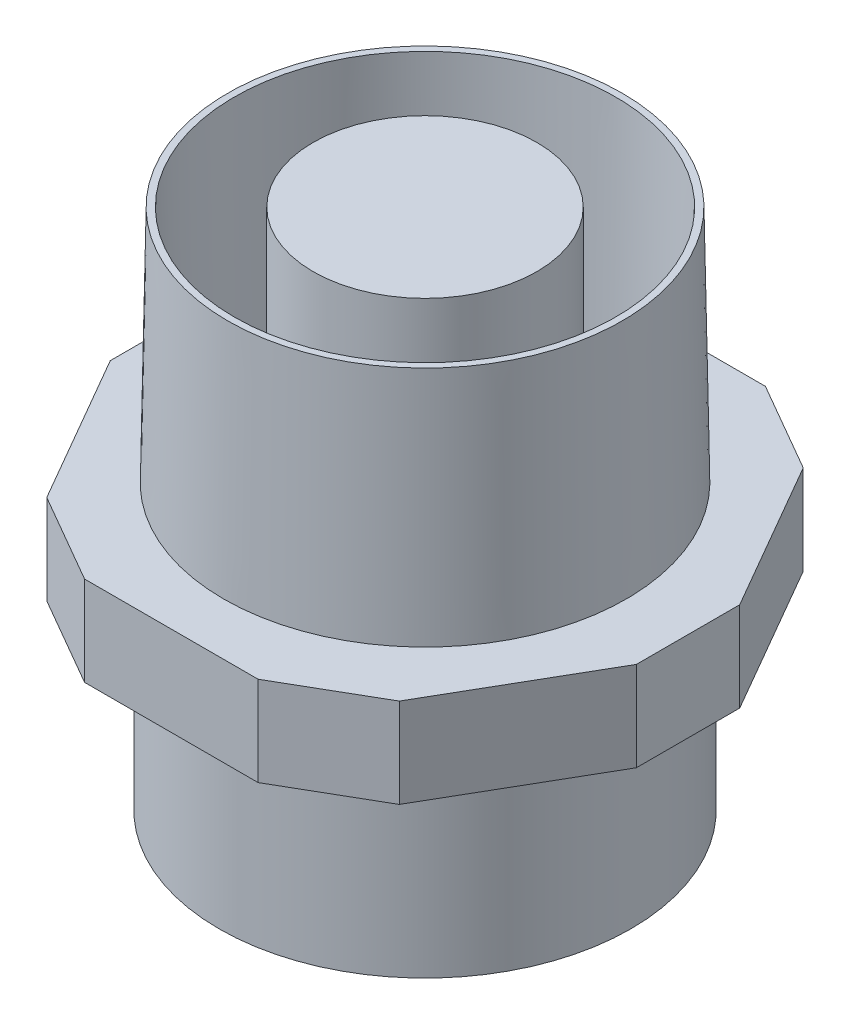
ISO-10303-21;
HEADER;
FILE_DESCRIPTION(('STEP AP214'),'2;1');
FILE_NAME('part.step','',(''),(''),'','','');
FILE_SCHEMA(('AUTOMOTIVE_DESIGN { 1 0 10303 214 1 1 1 1 }'));
ENDSEC;
DATA;
#1=APPLICATION_CONTEXT('core data for automotive mechanical design processes');
#2=APPLICATION_PROTOCOL_DEFINITION('international standard','automotive_design',2000,#1);
#3=PRODUCT_CONTEXT('',#1,'mechanical');
#4=PRODUCT('Part','Part','',(#3));
#5=PRODUCT_RELATED_PRODUCT_CATEGORY('part','',(#4));
#6=PRODUCT_DEFINITION_FORMATION('','',#4);
#7=PRODUCT_DEFINITION_CONTEXT('part definition',#1,'design');
#8=PRODUCT_DEFINITION('design','',#6,#7);
#9=PRODUCT_DEFINITION_SHAPE('','',#8);
#10=(LENGTH_UNIT() NAMED_UNIT(*) SI_UNIT(.MILLI.,.METRE.));
#11=(NAMED_UNIT(*) PLANE_ANGLE_UNIT() SI_UNIT($,.RADIAN.));
#12=(NAMED_UNIT(*) SI_UNIT($,.STERADIAN.) SOLID_ANGLE_UNIT());
#13=UNCERTAINTY_MEASURE_WITH_UNIT(LENGTH_MEASURE(1.E-05),#10,'distance_accuracy_value','');
#14=(GEOMETRIC_REPRESENTATION_CONTEXT(3) GLOBAL_UNCERTAINTY_ASSIGNED_CONTEXT((#13)) GLOBAL_UNIT_ASSIGNED_CONTEXT((#10,
#11,#12)) REPRESENTATION_CONTEXT('',''));
#15=CARTESIAN_POINT('',(0.,0.,0.));
#16=DIRECTION('',(0.,0.,1.));
#17=DIRECTION('',(1.,0.,0.));
#18=AXIS2_PLACEMENT_3D('',#15,#16,#17);
#19=CARTESIAN_POINT('',(9.81495457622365,3.,0.));
#20=DIRECTION('',(0.,1.,0.));
#21=DIRECTION('',(0.,0.,1.));
#22=AXIS2_PLACEMENT_3D('',#19,#20,#21);
#23=PLANE('',#22);
#24=CARTESIAN_POINT('',(0.,3.,0.));
#25=DIRECTION('',(0.,1.,0.));
#26=DIRECTION('',(0.,0.,1.));
#27=AXIS2_PLACEMENT_3D('',#24,#25,#26);
#28=CIRCLE('',#27,6.25);
#29=CARTESIAN_POINT('',(0.,3.,6.25));
#30=VERTEX_POINT('',#29);
#31=EDGE_CURVE('E176',#30,#30,#28,.F.);
#32=ORIENTED_EDGE('',*,*,#31,.F.);
#33=EDGE_LOOP('',(#32));
#34=FACE_BOUND('',#33,.T.);
#35=CARTESIAN_POINT('',(0.,3.,0.));
#36=DIRECTION('',(0.,1.,0.));
#37=DIRECTION('',(0.,0.,1.));
#38=AXIS2_PLACEMENT_3D('',#35,#36,#37);
#39=CIRCLE('',#38,3.75);
#40=CARTESIAN_POINT('',(0.,3.,3.75));
#41=VERTEX_POINT('',#40);
#42=EDGE_CURVE('E255',#41,#41,#39,.T.);
#43=ORIENTED_EDGE('',*,*,#42,.F.);
#44=EDGE_LOOP('',(#43));
#45=FACE_BOUND('',#44,.T.);
#46=ADVANCED_FACE('F38',(#34,#45),#23,.T.);
#47=CARTESIAN_POINT('',(9.81495457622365,0.,0.));
#48=DIRECTION('',(0.,1.,0.));
#49=DIRECTION('',(0.,0.,1.));
#50=AXIS2_PLACEMENT_3D('',#47,#48,#49);
#51=PLANE('',#50);
#52=DIRECTION('',(0.5,0.,-0.866025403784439));
#53=VECTOR('',#52,1.);
#54=CARTESIAN_POINT('',(4.90747728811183,0.,8.5));
#55=LINE('',#54,#53);
#56=CARTESIAN_POINT('',(5.90747728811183,0.,6.76794919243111));
#57=VERTEX_POINT('',#56);
#58=CARTESIAN_POINT('',(8.81495457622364,0.,1.73205080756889));
#59=VERTEX_POINT('',#58);
#60=EDGE_CURVE('E144',#57,#59,#55,.T.);
#61=ORIENTED_EDGE('',*,*,#60,.F.);
#62=DIRECTION('',(0.866025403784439,0.,-0.5));
#63=VECTOR('',#62,1.);
#64=CARTESIAN_POINT('',(5.90747728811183,0.,6.76794919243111));
#65=LINE('',#64,#63);
#66=CARTESIAN_POINT('',(2.90747728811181,0.,8.5));
#67=VERTEX_POINT('',#66);
#68=EDGE_CURVE('E127',#57,#67,#65,.F.);
#69=ORIENTED_EDGE('',*,*,#68,.T.);
#70=DIRECTION('',(1.,0.,0.));
#71=VECTOR('',#70,1.);
#72=CARTESIAN_POINT('',(-4.90747728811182,0.,8.5));
#73=LINE('',#72,#71);
#74=CARTESIAN_POINT('',(-2.90747728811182,0.,8.5));
#75=VERTEX_POINT('',#74);
#76=EDGE_CURVE('E174',#75,#67,#73,.T.);
#77=ORIENTED_EDGE('',*,*,#76,.F.);
#78=DIRECTION('',(0.866025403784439,0.,0.5));
#79=VECTOR('',#78,1.);
#80=CARTESIAN_POINT('',(-2.90747728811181,0.,8.5));
#81=LINE('',#80,#79);
#82=CARTESIAN_POINT('',(-5.90747728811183,0.,6.76794919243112));
#83=VERTEX_POINT('',#82);
#84=EDGE_CURVE('E184',#75,#83,#81,.F.);
#85=ORIENTED_EDGE('',*,*,#84,.T.);
#86=DIRECTION('',(0.5,0.,0.866025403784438));
#87=VECTOR('',#86,1.);
#88=CARTESIAN_POINT('',(-9.81495457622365,0.,0.));
#89=LINE('',#88,#87);
#90=CARTESIAN_POINT('',(-8.81495457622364,0.,1.73205080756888));
#91=VERTEX_POINT('',#90);
#92=EDGE_CURVE('E172',#91,#83,#89,.T.);
#93=ORIENTED_EDGE('',*,*,#92,.F.);
#94=DIRECTION('',(0.,0.,1.));
#95=VECTOR('',#94,1.);
#96=CARTESIAN_POINT('',(-8.81495457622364,0.,1.73205080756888));
#97=LINE('',#96,#95);
#98=CARTESIAN_POINT('',(-8.81495457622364,0.,-1.73205080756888));
#99=VERTEX_POINT('',#98);
#100=EDGE_CURVE('E148',#91,#99,#97,.F.);
#101=ORIENTED_EDGE('',*,*,#100,.T.);
#102=DIRECTION('',(-0.5,0.,0.866025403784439));
#103=VECTOR('',#102,1.);
#104=CARTESIAN_POINT('',(-4.90747728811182,0.,-8.50000000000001));
#105=LINE('',#104,#103);
#106=CARTESIAN_POINT('',(-5.90747728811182,0.,-6.76794919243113));
#107=VERTEX_POINT('',#106);
#108=EDGE_CURVE('E169',#107,#99,#105,.T.);
#109=ORIENTED_EDGE('',*,*,#108,.F.);
#110=DIRECTION('',(-0.866025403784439,0.,0.5));
#111=VECTOR('',#110,1.);
#112=CARTESIAN_POINT('',(-5.90747728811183,0.,-6.76794919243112));
#113=LINE('',#112,#111);
#114=CARTESIAN_POINT('',(-2.90747728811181,0.,-8.50000000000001));
#115=VERTEX_POINT('',#114);
#116=EDGE_CURVE('E186',#107,#115,#113,.F.);
#117=ORIENTED_EDGE('',*,*,#116,.T.);
#118=DIRECTION('',(-1.,0.,0.));
#119=VECTOR('',#118,1.);
#120=CARTESIAN_POINT('',(4.90747728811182,0.,-8.50000000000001));
#121=LINE('',#120,#119);
#122=CARTESIAN_POINT('',(2.90747728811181,0.,-8.50000000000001));
#123=VERTEX_POINT('',#122);
#124=EDGE_CURVE('E158',#123,#115,#121,.T.);
#125=ORIENTED_EDGE('',*,*,#124,.F.);
#126=DIRECTION('',(-0.866025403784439,0.,-0.5));
#127=VECTOR('',#126,1.);
#128=CARTESIAN_POINT('',(2.90747728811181,0.,-8.50000000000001));
#129=LINE('',#128,#127);
#130=CARTESIAN_POINT('',(5.90747728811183,0.,-6.76794919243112));
#131=VERTEX_POINT('',#130);
#132=EDGE_CURVE('E188',#123,#131,#129,.F.);
#133=ORIENTED_EDGE('',*,*,#132,.T.);
#134=DIRECTION('',(-0.5,0.,-0.866025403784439));
#135=VECTOR('',#134,1.);
#136=CARTESIAN_POINT('',(9.81495457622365,0.,0.));
#137=LINE('',#136,#135);
#138=CARTESIAN_POINT('',(8.81495457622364,0.,-1.73205080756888));
#139=VERTEX_POINT('',#138);
#140=EDGE_CURVE('E154',#139,#131,#137,.T.);
#141=ORIENTED_EDGE('',*,*,#140,.F.);
#142=DIRECTION('',(0.,0.,-1.));
#143=VECTOR('',#142,1.);
#144=CARTESIAN_POINT('',(8.81495457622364,0.,-1.73205080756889));
#145=LINE('',#144,#143);
#146=EDGE_CURVE('E138',#139,#59,#145,.F.);
#147=ORIENTED_EDGE('',*,*,#146,.T.);
#148=EDGE_LOOP('',(#61,#69,#77,#85,#93,#101,#109,#117,#125,#133,#141,#147));
#149=FACE_BOUND('',#148,.T.);
#150=CARTESIAN_POINT('',(0.,0.,0.));
#151=DIRECTION('',(0.,1.,0.));
#152=DIRECTION('',(0.,0.,1.));
#153=AXIS2_PLACEMENT_3D('',#150,#151,#152);
#154=CIRCLE('',#153,6.9);
#155=CARTESIAN_POINT('',(0.,0.,6.9));
#156=VERTEX_POINT('',#155);
#157=EDGE_CURVE('E179',#156,#156,#154,.F.);
#158=ORIENTED_EDGE('',*,*,#157,.F.);
#159=EDGE_LOOP('',(#158));
#160=FACE_BOUND('',#159,.T.);
#161=ADVANCED_FACE('F151',(#149,#160),#51,.F.);
#162=DIRECTION('',(1.,0.,0.));
#163=VECTOR('',#162,1.);
#164=CARTESIAN_POINT('',(-4.90747728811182,3.,8.5));
#165=LINE('',#164,#163);
#166=CARTESIAN_POINT('',(-2.90747728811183,3.,8.5));
#167=VERTEX_POINT('',#166);
#168=CARTESIAN_POINT('',(2.90747728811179,3.,8.50000000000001));
#169=VERTEX_POINT('',#168);
#170=EDGE_CURVE('E164',#167,#169,#165,.T.);
#171=ORIENTED_EDGE('',*,*,#170,.T.);
#172=DIRECTION('',(-0.866025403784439,0.,0.5));
#173=VECTOR('',#172,1.);
#174=CARTESIAN_POINT('',(11.7686932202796,3.,3.38397459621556));
#175=LINE('',#174,#173);
#176=CARTESIAN_POINT('',(5.90747728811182,3.,6.76794919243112));
#177=VERTEX_POINT('',#176);
#178=EDGE_CURVE('E203',#169,#177,#175,.F.);
#179=ORIENTED_EDGE('',*,*,#178,.T.);
#180=DIRECTION('',(0.5,0.,-0.866025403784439));
#181=VECTOR('',#180,1.);
#182=CARTESIAN_POINT('',(4.90747728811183,3.,8.5));
#183=LINE('',#182,#181);
#184=CARTESIAN_POINT('',(8.81495457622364,3.,1.73205080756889));
#185=VERTEX_POINT('',#184);
#186=EDGE_CURVE('E147',#177,#185,#183,.T.);
#187=ORIENTED_EDGE('',*,*,#186,.T.);
#188=DIRECTION('',(0.,0.,1.));
#189=VECTOR('',#188,1.);
#190=CARTESIAN_POINT('',(8.81495457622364,3.,0.));
#191=LINE('',#190,#189);
#192=CARTESIAN_POINT('',(8.81495457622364,3.,-1.73205080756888));
#193=VERTEX_POINT('',#192);
#194=EDGE_CURVE('E201',#185,#193,#191,.F.);
#195=ORIENTED_EDGE('',*,*,#194,.T.);
#196=DIRECTION('',(-0.5,0.,-0.866025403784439));
#197=VECTOR('',#196,1.);
#198=CARTESIAN_POINT('',(9.81495457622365,3.,0.));
#199=LINE('',#198,#197);
#200=CARTESIAN_POINT('',(5.90747728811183,3.,-6.76794919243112));
#201=VERTEX_POINT('',#200);
#202=EDGE_CURVE('E240',#193,#201,#199,.T.);
#203=ORIENTED_EDGE('',*,*,#202,.T.);
#204=DIRECTION('',(0.866025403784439,0.,0.5));
#205=VECTOR('',#204,1.);
#206=CARTESIAN_POINT('',(11.7686932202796,3.,-3.38397459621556));
#207=LINE('',#206,#205);
#208=CARTESIAN_POINT('',(2.9074772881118,3.,-8.50000000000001));
#209=VERTEX_POINT('',#208);
#210=EDGE_CURVE('E199',#201,#209,#207,.F.);
#211=ORIENTED_EDGE('',*,*,#210,.T.);
#212=DIRECTION('',(-1.,0.,0.));
#213=VECTOR('',#212,1.);
#214=CARTESIAN_POINT('',(4.90747728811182,3.,-8.50000000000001));
#215=LINE('',#214,#213);
#216=CARTESIAN_POINT('',(-2.90747728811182,3.,-8.50000000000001));
#217=VERTEX_POINT('',#216);
#218=EDGE_CURVE('E235',#209,#217,#215,.T.);
#219=ORIENTED_EDGE('',*,*,#218,.T.);
#220=DIRECTION('',(0.866025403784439,0.,-0.5));
#221=VECTOR('',#220,1.);
#222=CARTESIAN_POINT('',(2.95373864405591,3.,-11.8839745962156));
#223=LINE('',#222,#221);
#224=CARTESIAN_POINT('',(-5.90747728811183,3.,-6.76794919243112));
#225=VERTEX_POINT('',#224);
#226=EDGE_CURVE('E197',#217,#225,#223,.F.);
#227=ORIENTED_EDGE('',*,*,#226,.T.);
#228=DIRECTION('',(-0.5,0.,0.866025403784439));
#229=VECTOR('',#228,1.);
#230=CARTESIAN_POINT('',(-4.90747728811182,3.,-8.50000000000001));
#231=LINE('',#230,#229);
#232=CARTESIAN_POINT('',(-8.81495457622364,3.,-1.73205080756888));
#233=VERTEX_POINT('',#232);
#234=EDGE_CURVE('E234',#225,#233,#231,.T.);
#235=ORIENTED_EDGE('',*,*,#234,.T.);
#236=DIRECTION('',(0.,0.,-1.));
#237=VECTOR('',#236,1.);
#238=CARTESIAN_POINT('',(-8.81495457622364,3.,0.));
#239=LINE('',#238,#237);
#240=CARTESIAN_POINT('',(-8.81495457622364,3.,1.73205080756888));
#241=VERTEX_POINT('',#240);
#242=EDGE_CURVE('E58',#233,#241,#239,.F.);
#243=ORIENTED_EDGE('',*,*,#242,.T.);
#244=DIRECTION('',(0.5,0.,0.866025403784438));
#245=VECTOR('',#244,1.);
#246=CARTESIAN_POINT('',(-9.81495457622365,3.,0.));
#247=LINE('',#246,#245);
#248=CARTESIAN_POINT('',(-5.90747728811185,3.,6.76794919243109));
#249=VERTEX_POINT('',#248);
#250=EDGE_CURVE('E223',#241,#249,#247,.T.);
#251=ORIENTED_EDGE('',*,*,#250,.T.);
#252=DIRECTION('',(-0.866025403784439,0.,-0.5));
#253=VECTOR('',#252,1.);
#254=CARTESIAN_POINT('',(2.95373864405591,3.,11.8839745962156));
#255=LINE('',#254,#253);
#256=EDGE_CURVE('E195',#249,#167,#255,.F.);
#257=ORIENTED_EDGE('',*,*,#256,.T.);
#258=EDGE_LOOP('',(#171,#179,#187,#195,#203,#211,#219,#227,#235,#243,#251,#257));
#259=FACE_BOUND('',#258,.T.);
#260=CARTESIAN_POINT('',(0.,3.,0.));
#261=DIRECTION('',(0.,1.,0.));
#262=DIRECTION('',(0.,0.,1.));
#263=AXIS2_PLACEMENT_3D('',#260,#261,#262);
#264=CIRCLE('',#263,6.75);
#265=CARTESIAN_POINT('',(0.,3.,6.75));
#266=VERTEX_POINT('',#265);
#267=EDGE_CURVE('E161',#266,#266,#264,.T.);
#268=ORIENTED_EDGE('',*,*,#267,.F.);
#269=EDGE_LOOP('',(#268));
#270=FACE_BOUND('',#269,.T.);
#271=ADVANCED_FACE('F265',(#259,#270),#23,.T.);
#272=CARTESIAN_POINT('',(4.90747728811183,3.,8.5));
#273=DIRECTION('',(-0.866025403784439,0.,-0.5));
#274=DIRECTION('',(-0.5,0.,0.866025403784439));
#275=AXIS2_PLACEMENT_3D('',#272,#273,#274);
#276=PLANE('',#275);
#277=ORIENTED_EDGE('',*,*,#186,.F.);
#278=DIRECTION('',(0.,-1.,0.));
#279=VECTOR('',#278,1.);
#280=CARTESIAN_POINT('',(5.90747728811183,3.,6.76794919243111));
#281=LINE('',#280,#279);
#282=EDGE_CURVE('E131',#177,#57,#281,.T.);
#283=ORIENTED_EDGE('',*,*,#282,.T.);
#284=ORIENTED_EDGE('',*,*,#60,.T.);
#285=DIRECTION('',(0.,1.,0.));
#286=VECTOR('',#285,1.);
#287=CARTESIAN_POINT('',(8.81495457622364,3.,1.73205080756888));
#288=LINE('',#287,#286);
#289=EDGE_CURVE('E149',#59,#185,#288,.T.);
#290=ORIENTED_EDGE('',*,*,#289,.T.);
#291=EDGE_LOOP('',(#277,#283,#284,#290));
#292=FACE_BOUND('',#291,.T.);
#293=ADVANCED_FACE('F143',(#292),#276,.F.);
#294=CARTESIAN_POINT('',(9.81495457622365,3.,0.));
#295=DIRECTION('',(-0.866025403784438,0.,0.5));
#296=DIRECTION('',(0.5,0.,0.866025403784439));
#297=AXIS2_PLACEMENT_3D('',#294,#295,#296);
#298=PLANE('',#297);
#299=ORIENTED_EDGE('',*,*,#202,.F.);
#300=DIRECTION('',(0.,-1.,0.));
#301=VECTOR('',#300,1.);
#302=CARTESIAN_POINT('',(8.81495457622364,3.,-1.73205080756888));
#303=LINE('',#302,#301);
#304=EDGE_CURVE('E207',#193,#139,#303,.T.);
#305=ORIENTED_EDGE('',*,*,#304,.T.);
#306=ORIENTED_EDGE('',*,*,#140,.T.);
#307=DIRECTION('',(0.,1.,0.));
#308=VECTOR('',#307,1.);
#309=CARTESIAN_POINT('',(5.90747728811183,3.,-6.76794919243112));
#310=LINE('',#309,#308);
#311=EDGE_CURVE('E205',#131,#201,#310,.T.);
#312=ORIENTED_EDGE('',*,*,#311,.T.);
#313=EDGE_LOOP('',(#299,#305,#306,#312));
#314=FACE_BOUND('',#313,.T.);
#315=ADVANCED_FACE('F275',(#314),#298,.F.);
#316=CARTESIAN_POINT('',(4.90747728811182,3.,-8.50000000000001));
#317=DIRECTION('',(0.,0.,1.));
#318=DIRECTION('',(1.,0.,0.));
#319=AXIS2_PLACEMENT_3D('',#316,#317,#318);
#320=PLANE('',#319);
#321=ORIENTED_EDGE('',*,*,#218,.F.);
#322=DIRECTION('',(0.,-1.,0.));
#323=VECTOR('',#322,1.);
#324=CARTESIAN_POINT('',(2.90747728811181,3.,-8.50000000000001));
#325=LINE('',#324,#323);
#326=EDGE_CURVE('E212',#209,#123,#325,.T.);
#327=ORIENTED_EDGE('',*,*,#326,.T.);
#328=ORIENTED_EDGE('',*,*,#124,.T.);
#329=DIRECTION('',(0.,1.,0.));
#330=VECTOR('',#329,1.);
#331=CARTESIAN_POINT('',(-2.90747728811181,3.,-8.50000000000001));
#332=LINE('',#331,#330);
#333=EDGE_CURVE('E210',#115,#217,#332,.T.);
#334=ORIENTED_EDGE('',*,*,#333,.T.);
#335=EDGE_LOOP('',(#321,#327,#328,#334));
#336=FACE_BOUND('',#335,.T.);
#337=ADVANCED_FACE('F326',(#336),#320,.F.);
#338=CARTESIAN_POINT('',(-4.90747728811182,3.,-8.50000000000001));
#339=DIRECTION('',(0.866025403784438,0.,0.5));
#340=DIRECTION('',(0.5,0.,-0.866025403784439));
#341=AXIS2_PLACEMENT_3D('',#338,#339,#340);
#342=PLANE('',#341);
#343=ORIENTED_EDGE('',*,*,#234,.F.);
#344=DIRECTION('',(0.,-1.,0.));
#345=VECTOR('',#344,1.);
#346=CARTESIAN_POINT('',(-5.90747728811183,3.,-6.76794919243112));
#347=LINE('',#346,#345);
#348=EDGE_CURVE('E217',#225,#107,#347,.T.);
#349=ORIENTED_EDGE('',*,*,#348,.T.);
#350=ORIENTED_EDGE('',*,*,#108,.T.);
#351=DIRECTION('',(0.,1.,0.));
#352=VECTOR('',#351,1.);
#353=CARTESIAN_POINT('',(-8.81495457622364,3.,-1.73205080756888));
#354=LINE('',#353,#352);
#355=EDGE_CURVE('E215',#99,#233,#354,.T.);
#356=ORIENTED_EDGE('',*,*,#355,.T.);
#357=EDGE_LOOP('',(#343,#349,#350,#356));
#358=FACE_BOUND('',#357,.T.);
#359=ADVANCED_FACE('F318',(#358),#342,.F.);
#360=CARTESIAN_POINT('',(-9.81495457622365,3.,0.));
#361=DIRECTION('',(0.866025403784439,0.,-0.5));
#362=DIRECTION('',(-0.5,0.,-0.866025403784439));
#363=AXIS2_PLACEMENT_3D('',#360,#361,#362);
#364=PLANE('',#363);
#365=ORIENTED_EDGE('',*,*,#92,.T.);
#366=DIRECTION('',(0.,1.,0.));
#367=VECTOR('',#366,1.);
#368=CARTESIAN_POINT('',(-5.90747728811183,3.,6.76794919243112));
#369=LINE('',#368,#367);
#370=EDGE_CURVE('E11',#83,#249,#369,.T.);
#371=ORIENTED_EDGE('',*,*,#370,.T.);
#372=ORIENTED_EDGE('',*,*,#250,.F.);
#373=DIRECTION('',(0.,-1.,0.));
#374=VECTOR('',#373,1.);
#375=CARTESIAN_POINT('',(-8.81495457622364,3.,1.73205080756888));
#376=LINE('',#375,#374);
#377=EDGE_CURVE('E46',#241,#91,#376,.T.);
#378=ORIENTED_EDGE('',*,*,#377,.T.);
#379=EDGE_LOOP('',(#365,#371,#372,#378));
#380=FACE_BOUND('',#379,.T.);
#381=ADVANCED_FACE('F222',(#380),#364,.F.);
#382=CARTESIAN_POINT('',(-4.90747728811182,3.,8.5));
#383=DIRECTION('',(0.,0.,-1.));
#384=DIRECTION('',(-1.,0.,0.));
#385=AXIS2_PLACEMENT_3D('',#382,#383,#384);
#386=PLANE('',#385);
#387=ORIENTED_EDGE('',*,*,#76,.T.);
#388=DIRECTION('',(0.,1.,0.));
#389=VECTOR('',#388,1.);
#390=CARTESIAN_POINT('',(2.90747728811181,3.,8.5));
#391=LINE('',#390,#389);
#392=EDGE_CURVE('E132',#67,#169,#391,.T.);
#393=ORIENTED_EDGE('',*,*,#392,.T.);
#394=ORIENTED_EDGE('',*,*,#170,.F.);
#395=DIRECTION('',(0.,-1.,0.));
#396=VECTOR('',#395,1.);
#397=CARTESIAN_POINT('',(-2.90747728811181,3.,8.5));
#398=LINE('',#397,#396);
#399=EDGE_CURVE('E137',#167,#75,#398,.T.);
#400=ORIENTED_EDGE('',*,*,#399,.T.);
#401=EDGE_LOOP('',(#387,#393,#394,#400));
#402=FACE_BOUND('',#401,.T.);
#403=ADVANCED_FACE('F232',(#402),#386,.F.);
#404=CARTESIAN_POINT('',(0.,11.,0.));
#405=DIRECTION('',(0.,1.,0.));
#406=DIRECTION('',(0.,0.,1.));
#407=AXIS2_PLACEMENT_3D('',#404,#405,#406);
#408=PLANE('',#407);
#409=CARTESIAN_POINT('',(0.,11.,0.));
#410=DIRECTION('',(0.,1.,0.));
#411=DIRECTION('',(0.,0.,1.));
#412=AXIS2_PLACEMENT_3D('',#409,#410,#411);
#413=CIRCLE('',#412,6.61035948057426);
#414=CARTESIAN_POINT('',(0.,11.,6.61035948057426));
#415=VERTEX_POINT('',#414);
#416=EDGE_CURVE('E155',#415,#415,#413,.T.);
#417=ORIENTED_EDGE('',*,*,#416,.T.);
#418=EDGE_LOOP('',(#417));
#419=FACE_BOUND('',#418,.T.);
#420=CARTESIAN_POINT('',(0.,11.,0.));
#421=DIRECTION('',(0.,1.,0.));
#422=DIRECTION('',(0.,0.,1.));
#423=AXIS2_PLACEMENT_3D('',#420,#421,#422);
#424=CIRCLE('',#423,6.38964051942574);
#425=CARTESIAN_POINT('',(0.,11.,6.38964051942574));
#426=VERTEX_POINT('',#425);
#427=EDGE_CURVE('E244',#426,#426,#424,.T.);
#428=ORIENTED_EDGE('',*,*,#427,.F.);
#429=EDGE_LOOP('',(#428));
#430=FACE_BOUND('',#429,.T.);
#431=ADVANCED_FACE('F283',(#419,#430),#408,.T.);
#432=CARTESIAN_POINT('',(0.,3.,0.));
#433=DIRECTION('',(0.,-1.,0.));
#434=DIRECTION('',(0.,0.,1.));
#435=AXIS2_PLACEMENT_3D('',#432,#433,#434);
#436=CONICAL_SURFACE('',#435,6.75,0.0174532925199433);
#437=ORIENTED_EDGE('',*,*,#416,.F.);
#438=EDGE_LOOP('',(#437));
#439=FACE_BOUND('',#438,.T.);
#440=ORIENTED_EDGE('',*,*,#267,.T.);
#441=EDGE_LOOP('',(#440));
#442=FACE_BOUND('',#441,.T.);
#443=ADVANCED_FACE('F280',(#439,#442),#436,.T.);
#444=CARTESIAN_POINT('',(0.,3.,0.));
#445=DIRECTION('',(0.,1.,0.));
#446=DIRECTION('',(0.,0.,1.));
#447=AXIS2_PLACEMENT_3D('',#444,#445,#446);
#448=CONICAL_SURFACE('',#447,6.25,0.0174532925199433);
#449=ORIENTED_EDGE('',*,*,#427,.T.);
#450=EDGE_LOOP('',(#449));
#451=FACE_BOUND('',#450,.T.);
#452=ORIENTED_EDGE('',*,*,#31,.T.);
#453=EDGE_LOOP('',(#452));
#454=FACE_BOUND('',#453,.T.);
#455=ADVANCED_FACE('F282',(#451,#454),#448,.F.);
#456=CARTESIAN_POINT('',(0.,-6.5,0.));
#457=DIRECTION('',(0.,1.,0.));
#458=DIRECTION('',(0.,0.,1.));
#459=AXIS2_PLACEMENT_3D('',#456,#457,#458);
#460=CYLINDRICAL_SURFACE('',#459,6.9);
#461=CARTESIAN_POINT('',(0.,-6.5,0.));
#462=DIRECTION('',(0.,-1.,0.));
#463=DIRECTION('',(0.,0.,-1.));
#464=AXIS2_PLACEMENT_3D('',#461,#462,#463);
#465=CIRCLE('',#464,6.9);
#466=CARTESIAN_POINT('',(0.,-6.5,6.9));
#467=VERTEX_POINT('',#466);
#468=EDGE_CURVE('E246',#467,#467,#465,.T.);
#469=CARTESIAN_POINT('',(0.,-6.5,6.9));
#470=CARTESIAN_POINT('',(0.,-6.43229166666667,6.9));
#471=CARTESIAN_POINT('',(0.,-6.36458333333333,6.9));
#472=CARTESIAN_POINT('',(0.,-6.22916666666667,6.9));
#473=CARTESIAN_POINT('',(0.,-6.16145833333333,6.9));
#474=CARTESIAN_POINT('',(0.,-6.02604166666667,6.9));
#475=CARTESIAN_POINT('',(0.,-5.95833333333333,6.9));
#476=CARTESIAN_POINT('',(0.,-5.82291666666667,6.9));
#477=CARTESIAN_POINT('',(0.,-5.75520833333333,6.9));
#478=CARTESIAN_POINT('',(0.,-5.61979166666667,6.9));
#479=CARTESIAN_POINT('',(0.,-5.55208333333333,6.9));
#480=CARTESIAN_POINT('',(0.,-5.41666666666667,6.9));
#481=CARTESIAN_POINT('',(0.,-5.34895833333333,6.9));
#482=CARTESIAN_POINT('',(0.,-5.21354166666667,6.9));
#483=CARTESIAN_POINT('',(0.,-5.14583333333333,6.9));
#484=CARTESIAN_POINT('',(0.,-5.01041666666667,6.9));
#485=CARTESIAN_POINT('',(0.,-4.94270833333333,6.9));
#486=CARTESIAN_POINT('',(0.,-4.80729166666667,6.9));
#487=CARTESIAN_POINT('',(0.,-4.73958333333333,6.9));
#488=CARTESIAN_POINT('',(0.,-4.60416666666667,6.9));
#489=CARTESIAN_POINT('',(0.,-4.53645833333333,6.9));
#490=CARTESIAN_POINT('',(0.,-4.40104166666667,6.9));
#491=CARTESIAN_POINT('',(0.,-4.33333333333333,6.9));
#492=CARTESIAN_POINT('',(0.,-4.19791666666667,6.9));
#493=CARTESIAN_POINT('',(0.,-4.13020833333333,6.9));
#494=CARTESIAN_POINT('',(0.,-3.99479166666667,6.9));
#495=CARTESIAN_POINT('',(0.,-3.92708333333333,6.9));
#496=CARTESIAN_POINT('',(0.,-3.79166666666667,6.9));
#497=CARTESIAN_POINT('',(0.,-3.72395833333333,6.9));
#498=CARTESIAN_POINT('',(0.,-3.58854166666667,6.9));
#499=CARTESIAN_POINT('',(0.,-3.52083333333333,6.9));
#500=CARTESIAN_POINT('',(0.,-3.38541666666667,6.9));
#501=CARTESIAN_POINT('',(0.,-3.31770833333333,6.9));
#502=CARTESIAN_POINT('',(0.,-3.18229166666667,6.9));
#503=CARTESIAN_POINT('',(0.,-3.11458333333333,6.9));
#504=CARTESIAN_POINT('',(0.,-2.97916666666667,6.9));
#505=CARTESIAN_POINT('',(0.,-2.91145833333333,6.9));
#506=CARTESIAN_POINT('',(0.,-2.77604166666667,6.9));
#507=CARTESIAN_POINT('',(0.,-2.70833333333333,6.9));
#508=CARTESIAN_POINT('',(0.,-2.57291666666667,6.9));
#509=CARTESIAN_POINT('',(0.,-2.50520833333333,6.9));
#510=CARTESIAN_POINT('',(0.,-2.36979166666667,6.9));
#511=CARTESIAN_POINT('',(0.,-2.30208333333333,6.9));
#512=CARTESIAN_POINT('',(0.,-2.16666666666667,6.9));
#513=CARTESIAN_POINT('',(0.,-2.09895833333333,6.9));
#514=CARTESIAN_POINT('',(0.,-1.96354166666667,6.9));
#515=CARTESIAN_POINT('',(0.,-1.89583333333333,6.9));
#516=CARTESIAN_POINT('',(0.,-1.76041666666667,6.9));
#517=CARTESIAN_POINT('',(0.,-1.69270833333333,6.9));
#518=CARTESIAN_POINT('',(0.,-1.55729166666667,6.9));
#519=CARTESIAN_POINT('',(0.,-1.48958333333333,6.9));
#520=CARTESIAN_POINT('',(0.,-1.35416666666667,6.9));
#521=CARTESIAN_POINT('',(0.,-1.28645833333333,6.9));
#522=CARTESIAN_POINT('',(0.,-1.15104166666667,6.9));
#523=CARTESIAN_POINT('',(0.,-1.08333333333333,6.9));
#524=CARTESIAN_POINT('',(0.,-0.947916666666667,6.9));
#525=CARTESIAN_POINT('',(0.,-0.880208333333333,6.9));
#526=CARTESIAN_POINT('',(0.,-0.744791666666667,6.9));
#527=CARTESIAN_POINT('',(0.,-0.677083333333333,6.9));
#528=CARTESIAN_POINT('',(0.,-0.541666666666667,6.9));
#529=CARTESIAN_POINT('',(0.,-0.473958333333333,6.9));
#530=CARTESIAN_POINT('',(0.,-0.338541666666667,6.9));
#531=CARTESIAN_POINT('',(0.,-0.270833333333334,6.9));
#532=CARTESIAN_POINT('',(0.,-0.135416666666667,6.9));
#533=CARTESIAN_POINT('',(0.,-0.0677083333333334,6.9));
#534=CARTESIAN_POINT('',(0.,0.,6.9));
#535=B_SPLINE_CURVE_WITH_KNOTS('',3,(#469,#470,#471,#472,#473,#474,#475,#476,#477,#478,#479,
#480,#481,#482,#483,#484,#485,#486,#487,#488,#489,#490,#491,#492,#493,#494,#495,#496,#497,#498,
#499,#500,#501,#502,#503,#504,#505,#506,#507,#508,#509,#510,#511,#512,#513,#514,#515,#516,#517,
#518,#519,#520,#521,#522,#523,#524,#525,#526,#527,#528,#529,#530,#531,#532,#533,#534),
.UNSPECIFIED.,.F.,.F.,(4,2,2,2,2,2,2,2,2,2,2,2,2,2,2,2,2,2,2,2,2,2,2,2,2,2,2,2,2,2,2,2,4),(0.,
0.203124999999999,0.40625,0.609375,0.812499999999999,1.015625,1.21875,1.421875,1.625,1.828125,
2.03125,2.234375,2.4375,2.640625,2.84375,3.046875,3.25,3.453125,3.65625,3.859375,4.0625,
4.265625,4.46875,4.671875,4.875,5.078125,5.28125,5.484375,5.6875,5.890625,6.09375,6.296875,6.5),.UNSPECIFIED.);
#536=EDGE_CURVE('BSEAM290',#467,#156,#535,.T.);
#537=ORIENTED_EDGE('',*,*,#468,.F.);
#538=ORIENTED_EDGE('',*,*,#157,.T.);
#539=ORIENTED_EDGE('',*,*,#536,.T.);
#540=ORIENTED_EDGE('',*,*,#536,.F.);
#541=EDGE_LOOP('',(#537,#539,#538,#540));
#542=FACE_BOUND('',#541,.T.);
#543=ADVANCED_FACE('F290',(#542),#460,.T.);
#544=CARTESIAN_POINT('',(0.,-6.5,0.));
#545=DIRECTION('',(0.,-1.,0.));
#546=DIRECTION('',(0.,0.,-1.));
#547=AXIS2_PLACEMENT_3D('',#544,#545,#546);
#548=PLANE('',#547);
#549=ORIENTED_EDGE('',*,*,#468,.T.);
#550=EDGE_LOOP('',(#549));
#551=FACE_BOUND('',#550,.T.);
#552=ADVANCED_FACE('F298',(#551),#548,.T.);
#553=CARTESIAN_POINT('',(5.90747728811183,3.,6.76794919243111));
#554=DIRECTION('',(-0.5,0.,-0.866025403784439));
#555=DIRECTION('',(-0.866025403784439,0.,0.5));
#556=AXIS2_PLACEMENT_3D('',#553,#554,#555);
#557=PLANE('',#556);
#558=ORIENTED_EDGE('',*,*,#178,.F.);
#559=ORIENTED_EDGE('',*,*,#392,.F.);
#560=ORIENTED_EDGE('',*,*,#68,.F.);
#561=ORIENTED_EDGE('',*,*,#282,.F.);
#562=EDGE_LOOP('',(#558,#559,#560,#561));
#563=FACE_BOUND('',#562,.T.);
#564=ADVANCED_FACE('F130',(#563),#557,.F.);
#565=CARTESIAN_POINT('',(8.81495457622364,3.,-1.73205080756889));
#566=DIRECTION('',(-1.,0.,0.));
#567=DIRECTION('',(0.,0.,1.));
#568=AXIS2_PLACEMENT_3D('',#565,#566,#567);
#569=PLANE('',#568);
#570=ORIENTED_EDGE('',*,*,#194,.F.);
#571=ORIENTED_EDGE('',*,*,#289,.F.);
#572=ORIENTED_EDGE('',*,*,#146,.F.);
#573=ORIENTED_EDGE('',*,*,#304,.F.);
#574=EDGE_LOOP('',(#570,#571,#572,#573));
#575=FACE_BOUND('',#574,.T.);
#576=ADVANCED_FACE('F337',(#575),#569,.F.);
#577=CARTESIAN_POINT('',(2.90747728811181,3.,-8.50000000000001));
#578=DIRECTION('',(-0.5,0.,0.866025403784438));
#579=DIRECTION('',(0.866025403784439,0.,0.5));
#580=AXIS2_PLACEMENT_3D('',#577,#578,#579);
#581=PLANE('',#580);
#582=ORIENTED_EDGE('',*,*,#210,.F.);
#583=ORIENTED_EDGE('',*,*,#311,.F.);
#584=ORIENTED_EDGE('',*,*,#132,.F.);
#585=ORIENTED_EDGE('',*,*,#326,.F.);
#586=EDGE_LOOP('',(#582,#583,#584,#585));
#587=FACE_BOUND('',#586,.T.);
#588=ADVANCED_FACE('F330',(#587),#581,.F.);
#589=CARTESIAN_POINT('',(-5.90747728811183,3.,-6.76794919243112));
#590=DIRECTION('',(0.5,0.,0.866025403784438));
#591=DIRECTION('',(0.866025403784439,0.,-0.5));
#592=AXIS2_PLACEMENT_3D('',#589,#590,#591);
#593=PLANE('',#592);
#594=ORIENTED_EDGE('',*,*,#226,.F.);
#595=ORIENTED_EDGE('',*,*,#333,.F.);
#596=ORIENTED_EDGE('',*,*,#116,.F.);
#597=ORIENTED_EDGE('',*,*,#348,.F.);
#598=EDGE_LOOP('',(#594,#595,#596,#597));
#599=FACE_BOUND('',#598,.T.);
#600=ADVANCED_FACE('F314',(#599),#593,.F.);
#601=CARTESIAN_POINT('',(-2.90747728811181,3.,8.5));
#602=DIRECTION('',(0.5,0.,-0.866025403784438));
#603=DIRECTION('',(-0.866025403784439,0.,-0.5));
#604=AXIS2_PLACEMENT_3D('',#601,#602,#603);
#605=PLANE('',#604);
#606=ORIENTED_EDGE('',*,*,#256,.F.);
#607=ORIENTED_EDGE('',*,*,#370,.F.);
#608=ORIENTED_EDGE('',*,*,#84,.F.);
#609=ORIENTED_EDGE('',*,*,#399,.F.);
#610=EDGE_LOOP('',(#606,#607,#608,#609));
#611=FACE_BOUND('',#610,.T.);
#612=ADVANCED_FACE('F229',(#611),#605,.F.);
#613=CARTESIAN_POINT('',(-8.81495457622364,3.,1.73205080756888));
#614=DIRECTION('',(1.,0.,0.));
#615=DIRECTION('',(0.,0.,-1.));
#616=AXIS2_PLACEMENT_3D('',#613,#614,#615);
#617=PLANE('',#616);
#618=ORIENTED_EDGE('',*,*,#242,.F.);
#619=ORIENTED_EDGE('',*,*,#355,.F.);
#620=ORIENTED_EDGE('',*,*,#100,.F.);
#621=ORIENTED_EDGE('',*,*,#377,.F.);
#622=EDGE_LOOP('',(#618,#619,#620,#621));
#623=FACE_BOUND('',#622,.T.);
#624=ADVANCED_FACE('F40',(#623),#617,.F.);
#625=CARTESIAN_POINT('',(0.,21.6066017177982,0.));
#626=DIRECTION('',(0.,-1.,0.));
#627=DIRECTION('',(0.,0.,-1.));
#628=AXIS2_PLACEMENT_3D('',#625,#626,#627);
#629=CYLINDRICAL_SURFACE('',#628,3.75);
#630=ORIENTED_EDGE('',*,*,#42,.T.);
#631=EDGE_LOOP('',(#630));
#632=FACE_BOUND('',#631,.T.);
#633=CARTESIAN_POINT('',(0.,11.,0.));
#634=DIRECTION('',(0.,1.,0.));
#635=DIRECTION('',(0.,0.,1.));
#636=AXIS2_PLACEMENT_3D('',#633,#634,#635);
#637=CIRCLE('',#636,3.75);
#638=CARTESIAN_POINT('',(0.,11.,3.75));
#639=VERTEX_POINT('',#638);
#640=EDGE_CURVE('E252',#639,#639,#637,.T.);
#641=ORIENTED_EDGE('',*,*,#640,.F.);
#642=EDGE_LOOP('',(#641));
#643=FACE_BOUND('',#642,.T.);
#644=ADVANCED_FACE('F259',(#632,#643),#629,.T.);
#645=CARTESIAN_POINT('',(0.,11.,0.));
#646=DIRECTION('',(0.,1.,0.));
#647=DIRECTION('',(0.,0.,1.));
#648=AXIS2_PLACEMENT_3D('',#645,#646,#647);
#649=PLANE('',#648);
#650=ORIENTED_EDGE('',*,*,#640,.T.);
#651=EDGE_LOOP('',(#650));
#652=FACE_BOUND('',#651,.T.);
#653=ADVANCED_FACE('F303',(#652),#649,.T.);
#654=CLOSED_SHELL('',(#46,#161,#271,#293,#315,#337,#359,#381,#403,#431,#443,#455,#543,#552,#564,
#576,#588,#600,#612,#624,#644,#653));
#655=MANIFOLD_SOLID_BREP('B2',#654);
#656=ADVANCED_BREP_SHAPE_REPRESENTATION('',(#18,#655),#14);
#657=SHAPE_DEFINITION_REPRESENTATION(#9,#656);
ENDSEC;
END-ISO-10303-21;
